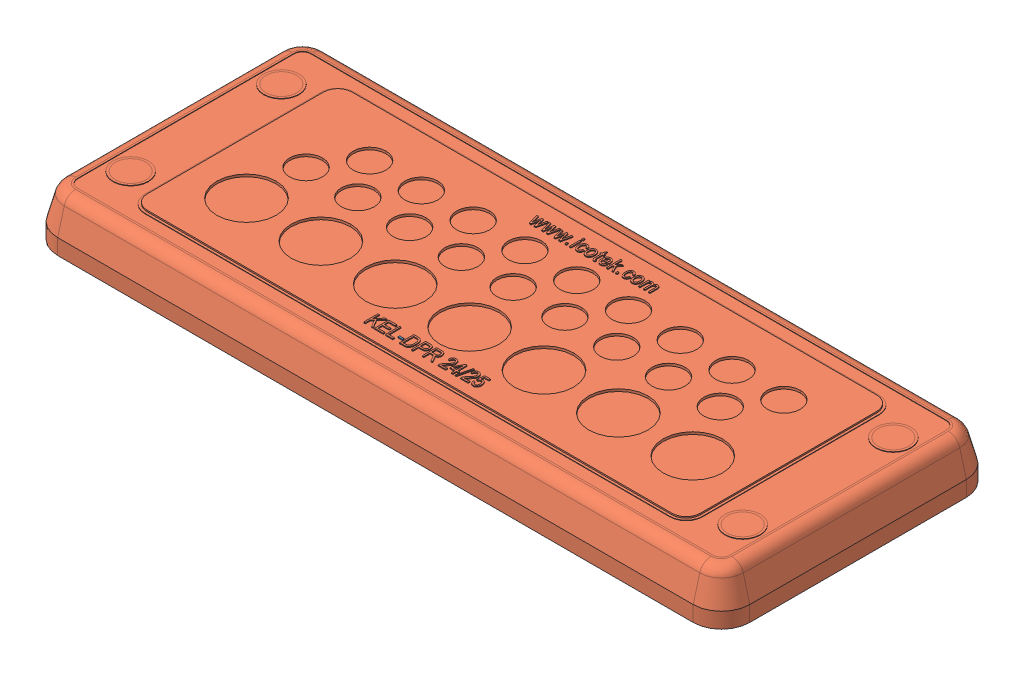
SolidWorks assembly 46502.SLDASM, configuration Default (file format 8000). Lengths in mm.
Overall size (147 10.8 58).
2 component instances, 2 part files, 0 mates.
Components (placement in the parent):
- 46502_01-1: 46502_01.SLDPRT [Default] at origin size (0.94 0.2 0.35)
- 46502_02-1: 46502_02.SLDPRT [Default] at origin size (147 10.8 58)
